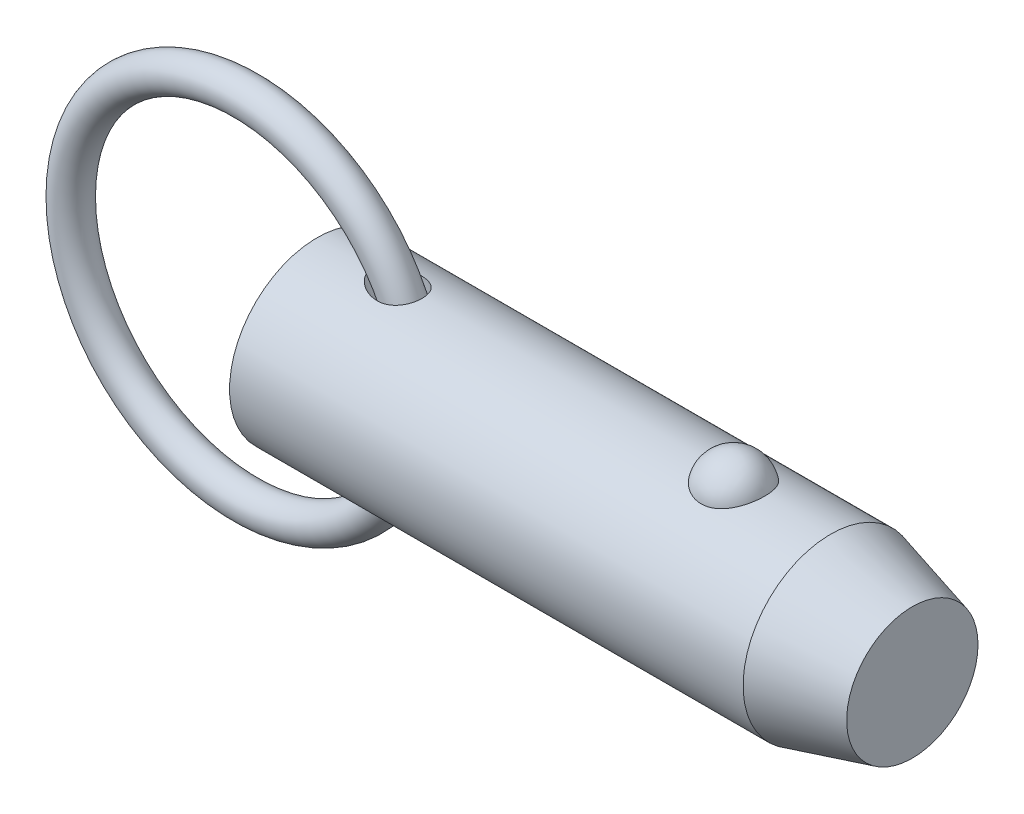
ISO-10303-21;
HEADER;
FILE_DESCRIPTION(('STEP AP214'),'2;1');
FILE_NAME('part.step','',(''),(''),'','','');
FILE_SCHEMA(('AUTOMOTIVE_DESIGN { 1 0 10303 214 1 1 1 1 }'));
ENDSEC;
DATA;
#1=APPLICATION_CONTEXT('core data for automotive mechanical design processes');
#2=APPLICATION_PROTOCOL_DEFINITION('international standard','automotive_design',2000,#1);
#3=PRODUCT_CONTEXT('',#1,'mechanical');
#4=PRODUCT('Part','Part','',(#3));
#5=PRODUCT_RELATED_PRODUCT_CATEGORY('part','',(#4));
#6=PRODUCT_DEFINITION_FORMATION('','',#4);
#7=PRODUCT_DEFINITION_CONTEXT('part definition',#1,'design');
#8=PRODUCT_DEFINITION('design','',#6,#7);
#9=PRODUCT_DEFINITION_SHAPE('','',#8);
#10=(LENGTH_UNIT() NAMED_UNIT(*) SI_UNIT(.MILLI.,.METRE.));
#11=(NAMED_UNIT(*) PLANE_ANGLE_UNIT() SI_UNIT($,.RADIAN.));
#12=(NAMED_UNIT(*) SI_UNIT($,.STERADIAN.) SOLID_ANGLE_UNIT());
#13=UNCERTAINTY_MEASURE_WITH_UNIT(LENGTH_MEASURE(1.E-05),#10,'distance_accuracy_value','');
#14=(GEOMETRIC_REPRESENTATION_CONTEXT(3) GLOBAL_UNCERTAINTY_ASSIGNED_CONTEXT((#13)) GLOBAL_UNIT_ASSIGNED_CONTEXT((#10,
#11,#12)) REPRESENTATION_CONTEXT('',''));
#15=CARTESIAN_POINT('',(0.,0.,0.));
#16=DIRECTION('',(0.,0.,1.));
#17=DIRECTION('',(1.,0.,0.));
#18=AXIS2_PLACEMENT_3D('',#15,#16,#17);
#19=CARTESIAN_POINT('',(-6.46799987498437,0.,0.));
#20=DIRECTION('',(0.,0.,1.));
#21=DIRECTION('',(1.,0.,0.));
#22=AXIS2_PLACEMENT_3D('',#19,#20,#21);
#23=TOROIDAL_SURFACE('',#22,15.875,1.588);
#24=CARTESIAN_POINT('',(10.9950001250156,0.,0.));
#25=VERTEX_POINT('',#24);
#26=VERTEX_LOOP('',#25);
#27=FACE_BOUND('',#26,.T.);
#28=ADVANCED_FACE('P0_F12',(#27),#23,.T.);
#29=CLOSED_SHELL('',(#28));
#30=MANIFOLD_SOLID_BREP('P0_B1',#29);
#31=CARTESIAN_POINT('',(0.,0.,0.));
#32=DIRECTION('',(1.,0.,0.));
#33=DIRECTION('',(0.,0.,-1.));
#34=AXIS2_PLACEMENT_3D('',#31,#32,#33);
#35=CYLINDRICAL_SURFACE('',#34,7.94);
#36=CARTESIAN_POINT('',(4.99454278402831,7.92831028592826,-0.430692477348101));
#37=CARTESIAN_POINT('',(5.02621962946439,7.92271974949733,-0.533554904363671));
#38=CARTESIAN_POINT('',(5.06869972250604,7.91528872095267,-0.633052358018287));
#39=CARTESIAN_POINT('',(5.17094751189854,7.89785690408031,-0.822566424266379));
#40=CARTESIAN_POINT('',(5.23077290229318,7.88784755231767,-0.912550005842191));
#41=CARTESIAN_POINT('',(5.37866013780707,7.8639674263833,-1.10117829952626));
#42=CARTESIAN_POINT('',(5.47004908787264,7.84973599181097,-1.19714712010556));
#43=CARTESIAN_POINT('',(5.66695490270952,7.82090787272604,-1.37293476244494));
#44=CARTESIAN_POINT('',(5.77247743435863,7.80631104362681,-1.45274707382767));
#45=CARTESIAN_POINT('',(5.99604254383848,7.77793596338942,-1.59776875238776));
#46=CARTESIAN_POINT('',(6.11428384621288,7.76417836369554,-1.66267404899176));
#47=CARTESIAN_POINT('',(6.35882685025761,7.73912410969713,-1.77564129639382));
#48=CARTESIAN_POINT('',(6.48513256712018,7.72782869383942,-1.82369477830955));
#49=CARTESIAN_POINT('',(6.76898453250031,7.70705630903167,-1.90977520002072));
#50=CARTESIAN_POINT('',(6.92778004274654,7.69837706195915,-1.94395681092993));
#51=CARTESIAN_POINT('',(7.24915504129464,7.6881294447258,-1.98412381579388));
#52=CARTESIAN_POINT('',(7.41173039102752,7.68655363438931,-1.99013871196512));
#53=CARTESIAN_POINT('',(7.697714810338,7.69094561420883,-1.97306069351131));
#54=CARTESIAN_POINT('',(7.82153338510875,7.69526202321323,-1.95634328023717));
#55=CARTESIAN_POINT('',(8.06460511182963,7.70859273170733,-1.90314615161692));
#56=CARTESIAN_POINT('',(8.18386164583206,7.7176034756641,-1.86668139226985));
#57=CARTESIAN_POINT('',(8.41450663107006,7.73959050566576,-1.77331230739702));
#58=CARTESIAN_POINT('',(8.52585042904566,7.75258738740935,-1.71630154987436));
#59=CARTESIAN_POINT('',(8.73575290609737,7.7809705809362,-1.58263416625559));
#60=CARTESIAN_POINT('',(8.8343144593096,7.7963563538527,-1.50598196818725));
#61=CARTESIAN_POINT('',(9.00639839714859,7.8259635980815,-1.34315626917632));
#62=CARTESIAN_POINT('',(9.08139772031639,7.84016008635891,-1.25853389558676));
#63=CARTESIAN_POINT('',(9.21545590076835,7.86710959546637,-1.07729126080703));
#64=CARTESIAN_POINT('',(9.27451869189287,7.87986297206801,-0.980673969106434));
#65=CARTESIAN_POINT('',(9.37315031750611,7.90198817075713,-0.782161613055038));
#66=CARTESIAN_POINT('',(9.41336512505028,7.91146854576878,-0.68059867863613));
#67=CARTESIAN_POINT('',(9.47650914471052,7.92664976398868,-0.471967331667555));
#68=CARTESIAN_POINT('',(9.49943917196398,7.93235078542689,-0.364899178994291));
#69=CARTESIAN_POINT('',(9.52744661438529,7.93934369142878,-0.14863226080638));
#70=CARTESIAN_POINT('',(9.53257574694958,7.9406483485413,-0.0394405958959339));
#71=CARTESIAN_POINT('',(9.52501411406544,7.93874464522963,0.178286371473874));
#72=CARTESIAN_POINT('',(9.51232314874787,7.93553623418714,0.286821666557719));
#73=CARTESIAN_POINT('',(9.46937875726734,7.92494527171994,0.500278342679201));
#74=CARTESIAN_POINT('',(9.43910562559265,7.9175580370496,0.605195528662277));
#75=CARTESIAN_POINT('',(9.36168926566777,7.8994090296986,0.808294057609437));
#76=CARTESIAN_POINT('',(9.31454677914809,7.88864740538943,0.906475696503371));
#77=CARTESIAN_POINT('',(9.20464679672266,7.86494645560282,1.09319438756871));
#78=CARTESIAN_POINT('',(9.14191093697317,7.85201015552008,1.18174456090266));
#79=CARTESIAN_POINT('',(9.00249124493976,7.82536913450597,1.34692675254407));
#80=CARTESIAN_POINT('',(8.92580850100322,7.81166447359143,1.42355969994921));
#81=CARTESIAN_POINT('',(8.76033130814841,7.78490157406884,1.56333296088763));
#82=CARTESIAN_POINT('',(8.67148512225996,7.77184644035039,1.62641250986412));
#83=CARTESIAN_POINT('',(8.48457694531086,7.74778101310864,1.73744892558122));
#84=CARTESIAN_POINT('',(8.3865141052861,7.73677090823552,1.78540439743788));
#85=CARTESIAN_POINT('',(8.18013312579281,7.71742695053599,1.86728938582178));
#86=CARTESIAN_POINT('',(8.07156725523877,7.7092102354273,1.90061897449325));
#87=CARTESIAN_POINT('',(7.85050876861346,7.6966502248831,1.95085652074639));
#88=CARTESIAN_POINT('',(7.73801453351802,7.69230854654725,1.967757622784));
#89=CARTESIAN_POINT('',(7.50002163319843,7.6873799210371,1.98693391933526));
#90=CARTESIAN_POINT('',(7.37438052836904,7.68722739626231,1.98751701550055));
#91=CARTESIAN_POINT('',(7.12435864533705,7.69142268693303,1.97121025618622));
#92=CARTESIAN_POINT('',(6.99997834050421,7.6957721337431,1.9543140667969));
#93=CARTESIAN_POINT('',(6.73521978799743,7.70925573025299,1.90049277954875));
#94=CARTESIAN_POINT('',(6.59543541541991,7.71903968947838,1.86081454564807));
#95=CARTESIAN_POINT('',(6.32319848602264,7.74233460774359,1.76138158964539));
#96=CARTESIAN_POINT('',(6.19076082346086,7.75585282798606,1.7015877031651));
#97=CARTESIAN_POINT('',(5.99269110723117,7.7785835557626,1.59336057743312));
#98=CARTESIAN_POINT('',(5.92332049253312,7.78707101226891,1.55151799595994));
#99=CARTESIAN_POINT('',(5.78862576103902,7.80440479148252,1.46183267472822));
#100=CARTESIAN_POINT('',(5.72330291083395,7.81325122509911,1.41398807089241));
#101=CARTESIAN_POINT('',(5.53492618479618,7.83980388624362,1.26162857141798));
#102=CARTESIAN_POINT('',(5.41884115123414,7.85759887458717,1.14795556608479));
#103=CARTESIAN_POINT('',(5.25731156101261,7.88350844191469,0.948390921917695));
#104=CARTESIAN_POINT('',(5.20241173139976,7.89260196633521,0.87019982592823));
#105=CARTESIAN_POINT('',(5.10541071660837,7.90897737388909,0.70602680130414));
#106=CARTESIAN_POINT('',(5.06329682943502,7.91626105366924,0.620052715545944));
#107=CARTESIAN_POINT('',(4.99458837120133,7.92827352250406,0.440665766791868));
#108=CARTESIAN_POINT('',(4.96816655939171,7.93297382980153,0.347182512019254));
#109=CARTESIAN_POINT('',(4.94275291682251,7.93751024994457,0.204498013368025));
#110=CARTESIAN_POINT('',(4.93665149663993,7.9386033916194,0.156529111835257));
#111=CARTESIAN_POINT('',(4.92932198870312,7.93991739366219,0.0602142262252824));
#112=CARTESIAN_POINT('',(4.9280924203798,7.94013851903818,0.011868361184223));
#113=CARTESIAN_POINT('',(4.93104052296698,7.93960920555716,-0.103241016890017));
#114=CARTESIAN_POINT('',(4.93747289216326,7.93845361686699,-0.169956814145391));
#115=CARTESIAN_POINT('',(4.95939910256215,7.93453812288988,-0.301777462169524));
#116=CARTESIAN_POINT('',(4.97489225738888,7.9317783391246,-0.36688243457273));
#117=CARTESIAN_POINT('',(4.99454278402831,7.92831028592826,-0.430692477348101));
#118=B_SPLINE_CURVE_WITH_KNOTS('',3,(#36,#37,#38,#39,#40,#41,#42,#43,#44,#45,#46,#47,#48,#49,
#50,#51,#52,#53,#54,#55,#56,#57,#58,#59,#60,#61,#62,#63,#64,#65,#66,#67,#68,#69,#70,#71,#72,#73,
#74,#75,#76,#77,#78,#79,#80,#81,#82,#83,#84,#85,#86,#87,#88,#89,#90,#91,#92,#93,#94,#95,#96,#97,
#98,#99,#100,#101,#102,#103,#104,#105,#106,#107,#108,#109,#110,#111,#112,#113,#114,#115,#116,
#117),.UNSPECIFIED.,.T.,.F.,(4,2,2,2,2,2,2,2,2,2,2,2,2,2,2,2,2,2,2,2,2,2,2,2,2,2,2,2,2,2,2,2,2,
2,2,2,2,2,2,2,4),(0.,0.323000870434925,0.647088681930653,1.04479679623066,1.4426648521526,
1.84804279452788,2.25362416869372,2.73917777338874,3.2242226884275,3.59772765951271,
3.97095014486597,4.34613445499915,4.72123425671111,5.06140749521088,5.40149668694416,
5.72887751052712,6.05624289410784,6.38265637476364,6.70907351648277,7.03585720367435,
7.36262652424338,7.68894495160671,8.01523792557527,8.34296459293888,8.67072147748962,
9.01089033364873,9.35120108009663,9.72668268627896,10.1023004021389,10.5375309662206,
10.9736138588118,11.2176803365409,11.461822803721,11.9480055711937,12.2349837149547,
12.5216758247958,12.8114683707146,12.9563497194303,13.1011870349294,13.3015737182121,
13.5019452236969),.UNSPECIFIED.);
#119=CARTESIAN_POINT('',(4.99454278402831,7.92831028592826,-0.430692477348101));
#120=VERTEX_POINT('',#119);
#121=EDGE_CURVE('P1_E40',#120,#120,#118,.T.);
#122=ORIENTED_EDGE('',*,*,#121,.T.);
#123=EDGE_LOOP('',(#122));
#124=FACE_BOUND('',#123,.T.);
#125=CARTESIAN_POINT('',(46.5718791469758,0.,0.));
#126=DIRECTION('',(1.,0.,0.));
#127=DIRECTION('',(0.,0.,-1.));
#128=AXIS2_PLACEMENT_3D('',#125,#126,#127);
#129=CIRCLE('',#128,7.94);
#130=CARTESIAN_POINT('',(46.5718791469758,0.,-7.94));
#131=VERTEX_POINT('',#130);
#132=EDGE_CURVE('P1_E25',#131,#131,#129,.T.);
#133=ORIENTED_EDGE('',*,*,#132,.F.);
#134=EDGE_LOOP('',(#133));
#135=FACE_BOUND('',#134,.T.);
#136=CARTESIAN_POINT('',(0.,0.,0.));
#137=DIRECTION('',(1.,0.,0.));
#138=DIRECTION('',(0.,0.,-1.));
#139=AXIS2_PLACEMENT_3D('',#136,#137,#138);
#140=CIRCLE('',#139,7.94);
#141=CARTESIAN_POINT('',(0.,0.,-7.94));
#142=VERTEX_POINT('',#141);
#143=EDGE_CURVE('P1_E9',#142,#142,#140,.T.);
#144=ORIENTED_EDGE('',*,*,#143,.T.);
#145=EDGE_LOOP('',(#144));
#146=FACE_BOUND('',#145,.T.);
#147=CARTESIAN_POINT('',(37.7649074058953,7.37767842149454,2.93486986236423));
#148=CARTESIAN_POINT('',(37.6127496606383,7.3776732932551,2.93487505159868));
#149=CARTESIAN_POINT('',(37.4606329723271,7.38258419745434,2.92262454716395));
#150=CARTESIAN_POINT('',(37.1609284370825,7.40163229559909,2.87404196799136));
#151=CARTESIAN_POINT('',(37.0133394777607,7.41576720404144,2.83771585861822));
#152=CARTESIAN_POINT('',(36.7270187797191,7.4516157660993,2.74218769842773));
#153=CARTESIAN_POINT('',(36.5882745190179,7.47331841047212,2.68301886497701));
#154=CARTESIAN_POINT('',(36.3228822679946,7.52194082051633,2.54350967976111));
#155=CARTESIAN_POINT('',(36.1962366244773,7.5488615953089,2.46316523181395));
#156=CARTESIAN_POINT('',(35.9545349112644,7.60594671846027,2.2809037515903));
#157=CARTESIAN_POINT('',(35.8399065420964,7.63618114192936,2.17844211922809));
#158=CARTESIAN_POINT('',(35.6288787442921,7.69614046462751,1.95608495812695));
#159=CARTESIAN_POINT('',(35.5324826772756,7.72586526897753,1.83618622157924));
#160=CARTESIAN_POINT('',(35.3559381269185,7.78314821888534,1.57628086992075));
#161=CARTESIAN_POINT('',(35.2767072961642,7.81055035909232,1.43561546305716));
#162=CARTESIAN_POINT('',(35.1417979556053,7.85879631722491,1.14236334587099));
#163=CARTESIAN_POINT('',(35.0861216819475,7.87963951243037,0.989775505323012));
#164=CARTESIAN_POINT('',(34.9988121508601,7.91289645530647,0.674619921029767));
#165=CARTESIAN_POINT('',(34.9675309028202,7.925186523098,0.511941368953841));
#166=CARTESIAN_POINT('',(34.930975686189,7.93958930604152,0.183247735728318));
#167=CARTESIAN_POINT('',(34.9257012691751,7.94170219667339,0.017232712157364));
#168=CARTESIAN_POINT('',(34.9412311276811,7.93554931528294,-0.31267286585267));
#169=CARTESIAN_POINT('',(34.9619253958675,7.92732732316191,-0.476569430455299));
#170=CARTESIAN_POINT('',(35.0287865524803,7.90141534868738,-0.79830524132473));
#171=CARTESIAN_POINT('',(35.0749539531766,7.88372517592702,-0.956144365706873));
#172=CARTESIAN_POINT('',(35.1918986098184,7.84066230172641,-1.26152073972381));
#173=CARTESIAN_POINT('',(35.2627046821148,7.81528060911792,-1.40904568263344));
#174=CARTESIAN_POINT('',(35.4274789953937,7.7594867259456,-1.68950598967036));
#175=CARTESIAN_POINT('',(35.5214488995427,7.72907417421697,-1.82244030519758));
#176=CARTESIAN_POINT('',(35.7308391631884,7.66640424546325,-2.07032792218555));
#177=CARTESIAN_POINT('',(35.8463152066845,7.63414223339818,-2.1852330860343));
#178=CARTESIAN_POINT('',(36.0959006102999,7.57149681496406,-2.39329737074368));
#179=CARTESIAN_POINT('',(36.2300080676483,7.54111321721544,-2.48645870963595));
#180=CARTESIAN_POINT('',(36.5101113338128,7.48650742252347,-2.64628132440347));
#181=CARTESIAN_POINT('',(36.6557605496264,7.46215900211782,-2.71350554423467));
#182=CARTESIAN_POINT('',(36.9574259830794,7.42171253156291,-2.82226614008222));
#183=CARTESIAN_POINT('',(37.1134383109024,7.40561140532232,-2.86381209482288));
#184=CARTESIAN_POINT('',(37.4229708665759,7.3842679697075,-2.9183907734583));
#185=CARTESIAN_POINT('',(37.5762229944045,7.37852109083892,-2.93275024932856));
#186=CARTESIAN_POINT('',(37.8830705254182,7.37700973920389,-2.93655208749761));
#187=CARTESIAN_POINT('',(38.0366658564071,7.38124333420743,-2.92599927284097));
#188=CARTESIAN_POINT('',(38.3349907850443,7.39890635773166,-2.88102897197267));
#189=CARTESIAN_POINT('',(38.4798480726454,7.41205491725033,-2.8473399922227));
#190=CARTESIAN_POINT('',(38.7616432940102,7.445801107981,-2.75788206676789));
#191=CARTESIAN_POINT('',(38.8985805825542,7.46639934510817,-2.70211132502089));
#192=CARTESIAN_POINT('',(39.1640619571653,7.51339098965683,-2.56858908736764));
#193=CARTESIAN_POINT('',(39.2923548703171,7.53990200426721,-2.49038067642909));
#194=CARTESIAN_POINT('',(39.5342440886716,7.59569503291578,-2.31462737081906));
#195=CARTESIAN_POINT('',(39.6478370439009,7.62497767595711,-2.21707808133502));
#196=CARTESIAN_POINT('',(39.86322156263,7.68489473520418,-1.99982049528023));
#197=CARTESIAN_POINT('',(39.9641488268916,7.71552419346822,-1.87925337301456));
#198=CARTESIAN_POINT('',(40.1451866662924,7.77353016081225,-1.62268826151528));
#199=CARTESIAN_POINT('',(40.2252934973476,7.80090608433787,-1.4866875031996));
#200=CARTESIAN_POINT('',(40.3653615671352,7.85047992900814,-1.19818413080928));
#201=CARTESIAN_POINT('',(40.4245877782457,7.8724818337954,-1.04529016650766));
#202=CARTESIAN_POINT('',(40.5179821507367,7.90785114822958,-0.731080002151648));
#203=CARTESIAN_POINT('',(40.5521497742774,7.92121837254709,-0.569763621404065));
#204=CARTESIAN_POINT('',(40.594795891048,7.93797834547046,-0.242812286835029));
#205=CARTESIAN_POINT('',(40.6032047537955,7.94134405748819,-0.0771668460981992));
#206=CARTESIAN_POINT('',(40.5939626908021,7.93767937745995,0.253276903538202));
#207=CARTESIAN_POINT('',(40.5763120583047,7.93064910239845,0.418075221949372));
#208=CARTESIAN_POINT('',(40.5154247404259,7.90695571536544,0.741525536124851));
#209=CARTESIAN_POINT('',(40.4722819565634,7.8903279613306,0.900197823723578));
#210=CARTESIAN_POINT('',(40.3613535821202,7.84916386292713,1.20759654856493));
#211=CARTESIAN_POINT('',(40.29356656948,7.82462706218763,1.35632241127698));
#212=CARTESIAN_POINT('',(40.1343718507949,7.7700669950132,1.64032869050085));
#213=CARTESIAN_POINT('',(40.0428616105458,7.7400200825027,1.77554712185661));
#214=CARTESIAN_POINT('',(39.8382960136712,7.67774175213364,2.02800648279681));
#215=CARTESIAN_POINT('',(39.7252410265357,7.64551037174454,2.14524772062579));
#216=CARTESIAN_POINT('',(39.4808318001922,7.58265895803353,2.35778002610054));
#217=CARTESIAN_POINT('',(39.3495833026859,7.5520309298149,2.45319004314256));
#218=CARTESIAN_POINT('',(39.071601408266,7.49579792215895,2.61999897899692));
#219=CARTESIAN_POINT('',(38.9248670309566,7.47019326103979,2.69139637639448));
#220=CARTESIAN_POINT('',(38.6129477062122,7.42622216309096,2.8105324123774));
#221=CARTESIAN_POINT('',(38.4472209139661,7.40825002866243,2.85700910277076));
#222=CARTESIAN_POINT('',(38.1092792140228,7.38398348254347,2.9191685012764));
#223=CARTESIAN_POINT('',(37.9370670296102,7.3776842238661,2.93486399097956));
#224=CARTESIAN_POINT('',(37.7649074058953,7.37767842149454,2.93486986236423));
#225=B_SPLINE_CURVE_WITH_KNOTS('',3,(#147,#148,#149,#150,#151,#152,#153,#154,#155,#156,#157,
#158,#159,#160,#161,#162,#163,#164,#165,#166,#167,#168,#169,#170,#171,#172,#173,#174,#175,#176,
#177,#178,#179,#180,#181,#182,#183,#184,#185,#186,#187,#188,#189,#190,#191,#192,#193,#194,#195,
#196,#197,#198,#199,#200,#201,#202,#203,#204,#205,#206,#207,#208,#209,#210,#211,#212,#213,#214,
#215,#216,#217,#218,#219,#220,#221,#222,#223,#224),.UNSPECIFIED.,.T.,.F.,(4,2,2,2,2,2,2,2,2,2,2,
2,2,2,2,2,2,2,2,2,2,2,2,2,2,2,2,2,2,2,2,2,2,2,2,2,2,2,4),(0.,0.45584132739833,0.911569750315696,
1.36663794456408,1.82179423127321,2.28978983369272,2.7578716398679,3.246853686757,
3.73588214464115,4.23184282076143,4.72779494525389,5.22165321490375,5.71552141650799,
6.20996917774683,6.70445245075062,7.20023431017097,7.69596557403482,8.18023418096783,
8.66432203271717,9.12410697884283,9.58380291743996,10.0296503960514,10.4755341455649,
10.9312349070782,11.3870393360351,11.8654416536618,12.3439299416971,12.8378875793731,
13.3318558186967,13.8271581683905,14.3224549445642,14.8159385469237,15.3094506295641,
15.8051323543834,16.3008055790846,16.7937101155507,17.2866458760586,17.8026240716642,
18.3183879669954),.UNSPECIFIED.);
#226=CARTESIAN_POINT('',(37.7649074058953,7.37767842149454,2.93486986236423));
#227=VERTEX_POINT('',#226);
#228=EDGE_CURVE('P1_E34',#227,#227,#225,.T.);
#229=ORIENTED_EDGE('',*,*,#228,.T.);
#230=EDGE_LOOP('',(#229));
#231=FACE_BOUND('',#230,.T.);
#232=CARTESIAN_POINT('',(4.99454278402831,-7.92831028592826,-0.430692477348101));
#233=CARTESIAN_POINT('',(4.97033227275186,-7.93258231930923,-0.352006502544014));
#234=CARTESIAN_POINT('',(4.95238785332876,-7.93578782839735,-0.271213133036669));
#235=CARTESIAN_POINT('',(4.93055628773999,-7.93969351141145,-0.107590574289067));
#236=CARTESIAN_POINT('',(4.92668686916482,-7.9403905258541,-0.0247589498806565));
#237=CARTESIAN_POINT('',(4.93338086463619,-7.93918950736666,0.140249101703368));
#238=CARTESIAN_POINT('',(4.94393526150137,-7.93729309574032,0.222425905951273));
#239=CARTESIAN_POINT('',(4.97854187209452,-7.93113325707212,0.383746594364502));
#240=CARTESIAN_POINT('',(5.00259804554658,-7.92686913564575,0.462889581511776));
#241=CARTESIAN_POINT('',(5.06904511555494,-7.91526143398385,0.633278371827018));
#242=CARTESIAN_POINT('',(5.11430124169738,-7.90744739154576,0.723368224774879));
#243=CARTESIAN_POINT('',(5.21873327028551,-7.88988375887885,0.894880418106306));
#244=CARTESIAN_POINT('',(5.27793532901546,-7.88013053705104,0.976286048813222));
#245=CARTESIAN_POINT('',(5.42949971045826,-7.85602233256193,1.15646341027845));
#246=CARTESIAN_POINT('',(5.52624420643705,-7.84124381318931,1.25147911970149));
#247=CARTESIAN_POINT('',(5.73364751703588,-7.81163164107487,1.42469165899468));
#248=CARTESIAN_POINT('',(5.84432059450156,-7.79679794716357,1.50287102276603));
#249=CARTESIAN_POINT('',(6.07871104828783,-7.76824211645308,1.64418004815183));
#250=CARTESIAN_POINT('',(6.20267992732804,-7.75455572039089,1.70689813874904));
#251=CARTESIAN_POINT('',(6.45850163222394,-7.73013259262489,1.81429879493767));
#252=CARTESIAN_POINT('',(6.5903577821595,-7.71939711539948,1.85897369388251));
#253=CARTESIAN_POINT('',(6.88209177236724,-7.70072462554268,1.93500734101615));
#254=CARTESIAN_POINT('',(7.04295460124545,-7.69356120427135,1.96286607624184));
#255=CARTESIAN_POINT('',(7.36724421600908,-7.68676336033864,1.98935053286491));
#256=CARTESIAN_POINT('',(7.53066723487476,-7.68711875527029,1.98801578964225));
#257=CARTESIAN_POINT('',(7.81370255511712,-7.69496475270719,1.95735673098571));
#258=CARTESIAN_POINT('',(7.93413357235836,-7.70066491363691,1.93505220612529));
#259=CARTESIAN_POINT('',(8.1695059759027,-7.71642704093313,1.87121573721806));
#260=CARTESIAN_POINT('',(8.28445128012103,-7.72648584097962,1.82969774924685));
#261=CARTESIAN_POINT('',(8.50557964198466,-7.75006886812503,1.72707806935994));
#262=CARTESIAN_POINT('',(8.61171927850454,-7.76360905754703,1.66588583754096));
#263=CARTESIAN_POINT('',(8.810712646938,-7.79249659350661,1.52503518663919));
#264=CARTESIAN_POINT('',(8.9035682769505,-7.80784368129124,1.44537941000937));
#265=CARTESIAN_POINT('',(9.06550151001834,-7.83702302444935,1.27723027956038));
#266=CARTESIAN_POINT('',(9.13591399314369,-7.85087516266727,1.19002179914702));
#267=CARTESIAN_POINT('',(9.26060432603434,-7.87675706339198,1.00451336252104));
#268=CARTESIAN_POINT('',(9.31488561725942,-7.88878721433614,0.906215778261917));
#269=CARTESIAN_POINT('',(9.40446618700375,-7.90930761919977,0.70456335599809));
#270=CARTESIAN_POINT('',(9.44028687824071,-7.91789338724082,0.601449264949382));
#271=CARTESIAN_POINT('',(9.49451523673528,-7.93109531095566,0.390496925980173));
#272=CARTESIAN_POINT('',(9.5129234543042,-7.93571159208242,0.282658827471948));
#273=CARTESIAN_POINT('',(9.53189686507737,-7.94047189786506,0.0654759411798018));
#274=CARTESIAN_POINT('',(9.53248611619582,-7.94062195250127,-0.0438666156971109));
#275=CARTESIAN_POINT('',(9.51587068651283,-7.93644929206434,-0.26110665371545));
#276=CARTESIAN_POINT('',(9.49866585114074,-7.93212653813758,-0.369004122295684));
#277=CARTESIAN_POINT('',(9.44682594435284,-7.91946859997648,-0.58038072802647));
#278=CARTESIAN_POINT('',(9.41217614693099,-7.91113002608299,-0.683856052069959));
#279=CARTESIAN_POINT('',(9.32626198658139,-7.89134774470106,-0.883337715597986));
#280=CARTESIAN_POINT('',(9.27499851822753,-7.87990420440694,-0.979344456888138));
#281=CARTESIAN_POINT('',(9.15725058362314,-7.8551872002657,-1.1610523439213));
#282=CARTESIAN_POINT('',(9.09078836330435,-7.84191642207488,-1.24676827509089));
#283=CARTESIAN_POINT('',(8.94443523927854,-7.81498501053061,-1.40574704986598));
#284=CARTESIAN_POINT('',(8.86454527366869,-7.80132440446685,-1.47901076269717));
#285=CARTESIAN_POINT('',(8.69307774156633,-7.77497848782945,-1.61181253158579));
#286=CARTESIAN_POINT('',(8.60142539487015,-7.76230033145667,-1.67125525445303));
#287=CARTESIAN_POINT('',(8.40957687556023,-7.73928987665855,-1.77477159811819));
#288=CARTESIAN_POINT('',(8.30937953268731,-7.72895790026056,-1.81884310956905));
#289=CARTESIAN_POINT('',(8.0986350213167,-7.71113842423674,-1.89300673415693));
#290=CARTESIAN_POINT('',(7.98782526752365,-7.70379913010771,-1.92238394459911));
#291=CARTESIAN_POINT('',(7.76294389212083,-7.69313871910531,-1.96460780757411));
#292=CARTESIAN_POINT('',(7.64887102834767,-7.68981915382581,-1.9774480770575));
#293=CARTESIAN_POINT('',(7.40716929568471,-7.68706358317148,-1.98813881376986));
#294=CARTESIAN_POINT('',(7.27945620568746,-7.68810537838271,-1.98414471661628));
#295=CARTESIAN_POINT('',(7.0259394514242,-7.6946815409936,-1.95847707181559));
#296=CARTESIAN_POINT('',(6.90013720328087,-7.7002190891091,-1.93679100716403));
#297=CARTESIAN_POINT('',(6.63265145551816,-7.71617635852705,-1.87230070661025));
#298=CARTESIAN_POINT('',(6.49169161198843,-7.72724102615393,-1.82664736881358));
#299=CARTESIAN_POINT('',(6.21840602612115,-7.75282261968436,-1.71482542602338));
#300=CARTESIAN_POINT('',(6.08608498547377,-7.76734140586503,-1.64864576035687));
#301=CARTESIAN_POINT('',(5.84453114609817,-7.7967744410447,-1.50297952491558));
#302=CARTESIAN_POINT('',(5.73429128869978,-7.81154606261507,-1.4251373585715));
#303=CARTESIAN_POINT('',(5.52761180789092,-7.84104229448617,-1.25271210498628));
#304=CARTESIAN_POINT('',(5.4311600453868,-7.85576693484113,-1.15814390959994));
#305=CARTESIAN_POINT('',(5.27970568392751,-7.87984260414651,-0.978603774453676));
#306=CARTESIAN_POINT('',(5.22040249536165,-7.88960721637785,-0.897319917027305));
#307=CARTESIAN_POINT('',(5.11583115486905,-7.90718602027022,-0.726171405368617));
#308=CARTESIAN_POINT('',(5.07050564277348,-7.9150081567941,-0.636343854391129));
#309=CARTESIAN_POINT('',(5.01937588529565,-7.92393751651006,-0.506165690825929));
#310=CARTESIAN_POINT('',(5.00622932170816,-7.926248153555,-0.468674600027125));
#311=CARTESIAN_POINT('',(4.99454278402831,-7.92831028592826,-0.430692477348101));
#312=B_SPLINE_CURVE_WITH_KNOTS('',3,(#232,#233,#234,#235,#236,#237,#238,#239,#240,#241,#242,
#243,#244,#245,#246,#247,#248,#249,#250,#251,#252,#253,#254,#255,#256,#257,#258,#259,#260,#261,
#262,#263,#264,#265,#266,#267,#268,#269,#270,#271,#272,#273,#274,#275,#276,#277,#278,#279,#280,
#281,#282,#283,#284,#285,#286,#287,#288,#289,#290,#291,#292,#293,#294,#295,#296,#297,#298,#299,
#300,#301,#302,#303,#304,#305,#306,#307,#308,#309,#310,#311),.UNSPECIFIED.,.T.,.F.,(4,2,2,2,2,2,
2,2,2,2,2,2,2,2,2,2,2,2,2,2,2,2,2,2,2,2,2,2,2,2,2,2,2,2,2,2,2,2,2,4),(0.,0.247186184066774,
0.494683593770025,0.742026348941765,0.989441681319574,1.29115800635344,1.59344478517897,
2.00047108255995,2.40791761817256,2.82525860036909,3.2427767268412,3.7304673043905,
4.21749746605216,4.58380730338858,4.94985148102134,5.31760488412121,5.68530568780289,
6.02244390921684,6.35951015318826,6.68644714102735,7.01337379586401,7.33985903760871,
7.66634711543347,7.9931112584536,8.31985780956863,8.64612913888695,8.97237768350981,
9.30081392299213,9.62929521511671,9.9724956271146,10.3158284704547,10.6977037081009,
11.0798493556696,11.523823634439,11.9680375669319,12.3738595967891,12.7793221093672,
13.0815405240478,13.3825016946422,13.5018197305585),.UNSPECIFIED.);
#313=CARTESIAN_POINT('',(4.99454278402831,-7.92831028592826,-0.430692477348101));
#314=VERTEX_POINT('',#313);
#315=EDGE_CURVE('P1_E17',#314,#314,#312,.T.);
#316=ORIENTED_EDGE('',*,*,#315,.T.);
#317=EDGE_LOOP('',(#316));
#318=FACE_BOUND('',#317,.T.);
#319=ADVANCED_FACE('P1_F13',(#124,#135,#146,#231,#318),#35,.T.);
#320=CARTESIAN_POINT('',(0.,0.,0.));
#321=DIRECTION('',(-1.,0.,0.));
#322=DIRECTION('',(0.,0.,1.));
#323=AXIS2_PLACEMENT_3D('',#320,#321,#322);
#324=PLANE('',#323);
#325=ORIENTED_EDGE('',*,*,#143,.F.);
#326=EDGE_LOOP('',(#325));
#327=FACE_BOUND('',#326,.T.);
#328=ADVANCED_FACE('P1_F15',(#327),#324,.T.);
#329=CARTESIAN_POINT('',(53.98,0.,0.));
#330=DIRECTION('',(-1.,0.,0.));
#331=DIRECTION('',(0.,0.,1.));
#332=AXIS2_PLACEMENT_3D('',#329,#330,#331);
#333=CONICAL_SURFACE('',#332,5.95500000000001,0.26179938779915);
#334=ORIENTED_EDGE('',*,*,#132,.T.);
#335=EDGE_LOOP('',(#334));
#336=FACE_BOUND('',#335,.T.);
#337=CARTESIAN_POINT('',(53.98,0.,0.));
#338=DIRECTION('',(1.,0.,0.));
#339=DIRECTION('',(0.,0.,-1.));
#340=AXIS2_PLACEMENT_3D('',#337,#338,#339);
#341=CIRCLE('',#340,5.95500000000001);
#342=CARTESIAN_POINT('',(53.98,0.,-5.95500000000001));
#343=VERTEX_POINT('',#342);
#344=EDGE_CURVE('P1_E30',#343,#343,#341,.T.);
#345=ORIENTED_EDGE('',*,*,#344,.F.);
#346=EDGE_LOOP('',(#345));
#347=FACE_BOUND('',#346,.T.);
#348=ADVANCED_FACE('P1_F55',(#336,#347),#333,.T.);
#349=CARTESIAN_POINT('',(53.98,5.95500000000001,0.));
#350=DIRECTION('',(1.,0.,0.));
#351=DIRECTION('',(0.,0.,-1.));
#352=AXIS2_PLACEMENT_3D('',#349,#350,#351);
#353=PLANE('',#352);
#354=ORIENTED_EDGE('',*,*,#344,.T.);
#355=EDGE_LOOP('',(#354));
#356=FACE_BOUND('',#355,.T.);
#357=ADVANCED_FACE('P1_F51',(#356),#353,.T.);
#358=CARTESIAN_POINT('',(37.7649074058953,7.146,0.));
#359=DIRECTION('',(-1.,0.,0.));
#360=DIRECTION('',(0.,1.,0.));
#361=AXIS2_PLACEMENT_3D('',#358,#359,#360);
#362=SPHERICAL_SURFACE('',#361,2.944);
#363=ORIENTED_EDGE('',*,*,#228,.F.);
#364=EDGE_LOOP('',(#363));
#365=FACE_BOUND('',#364,.T.);
#366=ADVANCED_FACE('P1_F46',(#365),#362,.T.);
#367=CARTESIAN_POINT('',(-6.46799987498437,0.,0.));
#368=DIRECTION('',(0.,0.,1.));
#369=DIRECTION('',(1.,0.,0.));
#370=AXIS2_PLACEMENT_3D('',#367,#368,#369);
#371=TOROIDAL_SURFACE('',#370,15.875,1.985);
#372=ORIENTED_EDGE('',*,*,#315,.F.);
#373=EDGE_LOOP('',(#372));
#374=FACE_BOUND('',#373,.T.);
#375=ORIENTED_EDGE('',*,*,#121,.F.);
#376=EDGE_LOOP('',(#375));
#377=FACE_BOUND('',#376,.T.);
#378=ADVANCED_FACE('P1_F50',(#374,#377),#371,.F.);
#379=CLOSED_SHELL('',(#319,#328,#348,#357,#366,#378));
#380=MANIFOLD_SOLID_BREP('P1_B1',#379);
#381=ADVANCED_BREP_SHAPE_REPRESENTATION('',(#18,#30,#380),#14);
#382=SHAPE_DEFINITION_REPRESENTATION(#9,#381);
ENDSEC;
END-ISO-10303-21;
